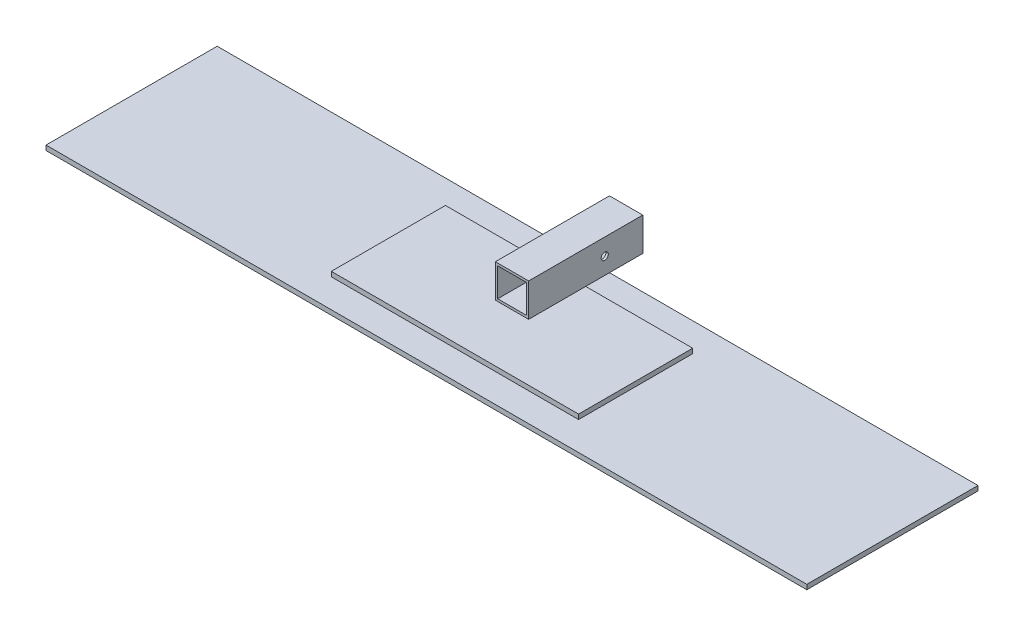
from build123d import *

# Parameters (mm, degrees)
SKETCH1_W                 = 1016
SKETCH1_H                 = 228.6
BOSS_EXTRUDE1_DEPTH       = 6.35
SMALL_PANEL_W             = 330.2
SMALL_PANEL_H             = 152.4
BOSS_EXTRUDE2_DEPTH       = 6.35
ARM_ATTACHMENT_SLEEVE_W   = 44.45
ARM_ATTACHMENT_SLEEVE_H   = 44.45
ARM_ATTACHMENT_SLEEVE_W_2 = 38.1
ARM_ATTACHMENT_SLEEVE_H_2 = 38.1
BOSS_EXTRUDE3_DEPTH       = 152.4
SKETCH7_R                 = 4.7625
CUT_EXTRUDE1_DEPTH        = 555.64442044


with BuildPart() as part:
    # Sketch1 → Boss-Extrude1 (new body)
    with BuildSketch(Plane(origin=(0, 0, 0), x_dir=(1, 0, 0), z_dir=(0, 1, 0))):
        Rectangle(SKETCH1_W, SKETCH1_H)
    extrude(amount=BOSS_EXTRUDE1_DEPTH)

    # small panel → Boss-Extrude2 (add)
    with BuildSketch(Plane(origin=(0, 6.35, 0), x_dir=(1, 0, 0), z_dir=(0, 1, 0))):
        Rectangle(SMALL_PANEL_W, SMALL_PANEL_H)
    extrude(amount=BOSS_EXTRUDE2_DEPTH)

    # arm attachment sleeve → Boss-Extrude3 (add)
    with BuildSketch(Plane.XY):
        with Locations((0, 34.925)):
            Rectangle(ARM_ATTACHMENT_SLEEVE_W, ARM_ATTACHMENT_SLEEVE_H)
        with Locations((0, 34.925)):
            Rectangle(ARM_ATTACHMENT_SLEEVE_W_2, ARM_ATTACHMENT_SLEEVE_H_2, mode=Mode.SUBTRACT)
    extrude(amount=-BOSS_EXTRUDE3_DEPTH)

    # Sketch7 → Cut-Extrude1 (cut, through all)
    with BuildSketch(Plane.ZY.offset(22.225)):
        with Locations(Location((-101.6, 34.925, 0), (0, 0, 270))):
            Circle(SKETCH7_R)
    extrude(amount=-CUT_EXTRUDE1_DEPTH, mode=Mode.SUBTRACT)


solid = part.part
